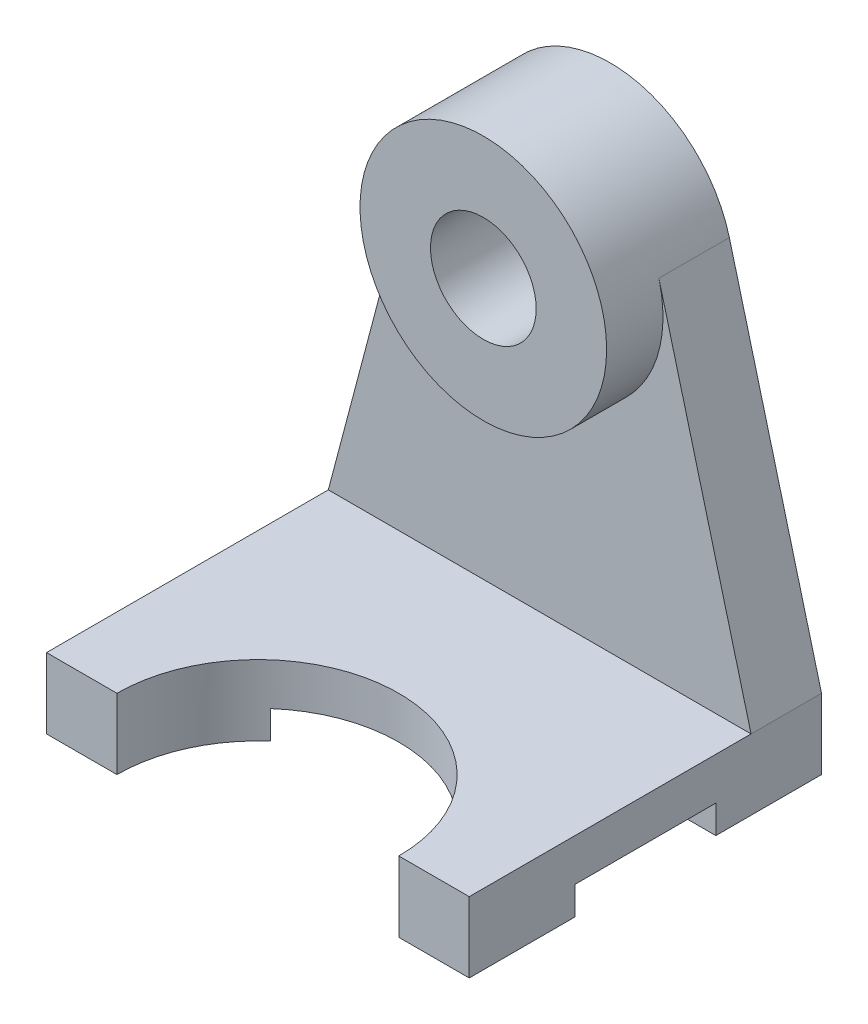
ISO-10303-21;
HEADER;
FILE_DESCRIPTION(('STEP AP214'),'2;1');
FILE_NAME('part.step','',(''),(''),'','','');
FILE_SCHEMA(('AUTOMOTIVE_DESIGN { 1 0 10303 214 1 1 1 1 }'));
ENDSEC;
DATA;
#1=APPLICATION_CONTEXT('core data for automotive mechanical design processes');
#2=APPLICATION_PROTOCOL_DEFINITION('international standard','automotive_design',2000,#1);
#3=PRODUCT_CONTEXT('',#1,'mechanical');
#4=PRODUCT('Part','Part','',(#3));
#5=PRODUCT_RELATED_PRODUCT_CATEGORY('part','',(#4));
#6=PRODUCT_DEFINITION_FORMATION('','',#4);
#7=PRODUCT_DEFINITION_CONTEXT('part definition',#1,'design');
#8=PRODUCT_DEFINITION('design','',#6,#7);
#9=PRODUCT_DEFINITION_SHAPE('','',#8);
#10=(LENGTH_UNIT() NAMED_UNIT(*) SI_UNIT(.MILLI.,.METRE.));
#11=(NAMED_UNIT(*) PLANE_ANGLE_UNIT() SI_UNIT($,.RADIAN.));
#12=(NAMED_UNIT(*) SI_UNIT($,.STERADIAN.) SOLID_ANGLE_UNIT());
#13=UNCERTAINTY_MEASURE_WITH_UNIT(LENGTH_MEASURE(1.E-05),#10,'distance_accuracy_value','');
#14=(GEOMETRIC_REPRESENTATION_CONTEXT(3) GLOBAL_UNCERTAINTY_ASSIGNED_CONTEXT((#13)) GLOBAL_UNIT_ASSIGNED_CONTEXT((#10,
#11,#12)) REPRESENTATION_CONTEXT('',''));
#15=CARTESIAN_POINT('',(0.,0.,0.));
#16=DIRECTION('',(0.,0.,1.));
#17=DIRECTION('',(1.,0.,0.));
#18=AXIS2_PLACEMENT_3D('',#15,#16,#17);
#19=CARTESIAN_POINT('',(30.,55.,-40.));
#20=DIRECTION('',(0.,0.,-1.));
#21=DIRECTION('',(-1.,0.,0.));
#22=AXIS2_PLACEMENT_3D('',#19,#20,#21);
#23=PLANE('',#22);
#24=CARTESIAN_POINT('',(30.,55.,-40.));
#25=DIRECTION('',(0.,0.,1.));
#26=DIRECTION('',(1.,0.,0.));
#27=AXIS2_PLACEMENT_3D('',#24,#25,#26);
#28=CIRCLE('',#27,17.5);
#29=CARTESIAN_POINT('',(13.081433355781,59.4734888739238,-40.));
#30=VERTEX_POINT('',#29);
#31=CARTESIAN_POINT('',(46.918566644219,59.4734888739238,-40.));
#32=VERTEX_POINT('',#31);
#33=EDGE_CURVE('E141',#30,#32,#28,.T.);
#34=ORIENTED_EDGE('',*,*,#33,.F.);
#35=DIRECTION('',(0.255627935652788,0.966775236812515,0.));
#36=VECTOR('',#35,1.);
#37=CARTESIAN_POINT('',(13.081433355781,59.4734888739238,-40.));
#38=LINE('',#37,#36);
#39=CARTESIAN_POINT('',(0.,10.,-40.));
#40=VERTEX_POINT('',#39);
#41=EDGE_CURVE('E48',#40,#30,#38,.T.);
#42=ORIENTED_EDGE('',*,*,#41,.F.);
#43=DIRECTION('',(-1.,0.,0.));
#44=VECTOR('',#43,1.);
#45=CARTESIAN_POINT('',(60.,10.,-40.));
#46=LINE('',#45,#44);
#47=CARTESIAN_POINT('',(60.,10.,-40.));
#48=VERTEX_POINT('',#47);
#49=EDGE_CURVE('E144',#48,#40,#46,.T.);
#50=ORIENTED_EDGE('',*,*,#49,.F.);
#51=DIRECTION('',(0.255627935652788,-0.966775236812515,0.));
#52=VECTOR('',#51,1.);
#53=CARTESIAN_POINT('',(46.918566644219,59.4734888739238,-40.));
#54=LINE('',#53,#52);
#55=EDGE_CURVE('E138',#32,#48,#54,.T.);
#56=ORIENTED_EDGE('',*,*,#55,.F.);
#57=EDGE_LOOP('',(#34,#42,#50,#56));
#58=FACE_BOUND('',#57,.T.);
#59=ADVANCED_FACE('F31',(#58),#23,.F.);
#60=CARTESIAN_POINT('',(30.,10.,0.));
#61=DIRECTION('',(0.,1.,0.));
#62=DIRECTION('',(0.,0.,1.));
#63=AXIS2_PLACEMENT_3D('',#60,#61,#62);
#64=PLANE('',#63);
#65=DIRECTION('',(0.,0.,-1.));
#66=VECTOR('',#65,1.);
#67=CARTESIAN_POINT('',(60.,10.,0.));
#68=LINE('',#67,#66);
#69=CARTESIAN_POINT('',(60.,10.,0.));
#70=VERTEX_POINT('',#69);
#71=EDGE_CURVE('E233',#70,#48,#68,.T.);
#72=ORIENTED_EDGE('',*,*,#71,.T.);
#73=ORIENTED_EDGE('',*,*,#49,.T.);
#74=DIRECTION('',(0.,0.,1.));
#75=VECTOR('',#74,1.);
#76=CARTESIAN_POINT('',(0.,10.,0.));
#77=LINE('',#76,#75);
#78=CARTESIAN_POINT('',(0.,10.,0.));
#79=VERTEX_POINT('',#78);
#80=EDGE_CURVE('E229',#40,#79,#77,.T.);
#81=ORIENTED_EDGE('',*,*,#80,.T.);
#82=DIRECTION('',(1.,0.,0.));
#83=VECTOR('',#82,1.);
#84=CARTESIAN_POINT('',(0.,10.,0.));
#85=LINE('',#84,#83);
#86=CARTESIAN_POINT('',(9.99999999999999,10.,0.));
#87=VERTEX_POINT('',#86);
#88=EDGE_CURVE('E225',#79,#87,#85,.T.);
#89=ORIENTED_EDGE('',*,*,#88,.T.);
#90=CARTESIAN_POINT('',(30.,10.,0.));
#91=DIRECTION('',(0.,-1.,0.));
#92=DIRECTION('',(0.,0.,1.));
#93=AXIS2_PLACEMENT_3D('',#90,#91,#92);
#94=CIRCLE('',#93,20.);
#95=CARTESIAN_POINT('',(50.,10.,0.));
#96=VERTEX_POINT('',#95);
#97=EDGE_CURVE('E291',#87,#96,#94,.T.);
#98=ORIENTED_EDGE('',*,*,#97,.T.);
#99=DIRECTION('',(1.,0.,0.));
#100=VECTOR('',#99,1.);
#101=CARTESIAN_POINT('',(50.,10.,0.));
#102=LINE('',#101,#100);
#103=EDGE_CURVE('E237',#96,#70,#102,.T.);
#104=ORIENTED_EDGE('',*,*,#103,.T.);
#105=EDGE_LOOP('',(#72,#73,#81,#89,#98,#104));
#106=FACE_BOUND('',#105,.T.);
#107=ADVANCED_FACE('F294',(#106),#64,.T.);
#108=CARTESIAN_POINT('',(30.,0.,0.));
#109=DIRECTION('',(0.,1.,0.));
#110=DIRECTION('',(0.,0.,1.));
#111=AXIS2_PLACEMENT_3D('',#108,#109,#110);
#112=PLANE('',#111);
#113=DIRECTION('',(0.,0.,1.));
#114=VECTOR('',#113,1.);
#115=CARTESIAN_POINT('',(0.,0.,0.));
#116=LINE('',#115,#114);
#117=CARTESIAN_POINT('',(0.,0.,-15.));
#118=VERTEX_POINT('',#117);
#119=CARTESIAN_POINT('',(0.,0.,0.));
#120=VERTEX_POINT('',#119);
#121=EDGE_CURVE('E222',#118,#120,#116,.T.);
#122=ORIENTED_EDGE('',*,*,#121,.F.);
#123=DIRECTION('',(1.,0.,0.));
#124=VECTOR('',#123,1.);
#125=CARTESIAN_POINT('',(0.,0.,-15.));
#126=LINE('',#125,#124);
#127=CARTESIAN_POINT('',(16.771243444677,0.,-15.));
#128=VERTEX_POINT('',#127);
#129=EDGE_CURVE('E197',#118,#128,#126,.T.);
#130=ORIENTED_EDGE('',*,*,#129,.T.);
#131=CARTESIAN_POINT('',(30.,0.,0.));
#132=DIRECTION('',(0.,-1.,0.));
#133=DIRECTION('',(0.,0.,1.));
#134=AXIS2_PLACEMENT_3D('',#131,#132,#133);
#135=CIRCLE('',#134,20.);
#136=CARTESIAN_POINT('',(9.99999999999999,0.,0.));
#137=VERTEX_POINT('',#136);
#138=EDGE_CURVE('E247',#137,#128,#135,.T.);
#139=ORIENTED_EDGE('',*,*,#138,.F.);
#140=DIRECTION('',(1.,0.,0.));
#141=VECTOR('',#140,1.);
#142=CARTESIAN_POINT('',(0.,0.,0.));
#143=LINE('',#142,#141);
#144=EDGE_CURVE('E244',#120,#137,#143,.T.);
#145=ORIENTED_EDGE('',*,*,#144,.F.);
#146=EDGE_LOOP('',(#122,#130,#139,#145));
#147=FACE_BOUND('',#146,.T.);
#148=ADVANCED_FACE('F286',(#147),#112,.F.);
#149=CARTESIAN_POINT('',(43.2287565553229,0.,-15.));
#150=VERTEX_POINT('',#149);
#151=CARTESIAN_POINT('',(50.,0.,0.));
#152=VERTEX_POINT('',#151);
#153=EDGE_CURVE('E246',#150,#152,#135,.T.);
#154=ORIENTED_EDGE('',*,*,#153,.F.);
#155=DIRECTION('',(1.,0.,0.));
#156=VECTOR('',#155,1.);
#157=CARTESIAN_POINT('',(30.,0.,-15.));
#158=LINE('',#157,#156);
#159=CARTESIAN_POINT('',(60.,0.,-15.));
#160=VERTEX_POINT('',#159);
#161=EDGE_CURVE('E11',#150,#160,#158,.T.);
#162=ORIENTED_EDGE('',*,*,#161,.T.);
#163=DIRECTION('',(0.,0.,-1.));
#164=VECTOR('',#163,1.);
#165=CARTESIAN_POINT('',(60.,0.,0.));
#166=LINE('',#165,#164);
#167=CARTESIAN_POINT('',(60.,0.,0.));
#168=VERTEX_POINT('',#167);
#169=EDGE_CURVE('E253',#168,#160,#166,.T.);
#170=ORIENTED_EDGE('',*,*,#169,.F.);
#171=DIRECTION('',(1.,0.,0.));
#172=VECTOR('',#171,1.);
#173=CARTESIAN_POINT('',(50.,0.,0.));
#174=LINE('',#173,#172);
#175=EDGE_CURVE('E250',#152,#168,#174,.T.);
#176=ORIENTED_EDGE('',*,*,#175,.F.);
#177=EDGE_LOOP('',(#154,#162,#170,#176));
#178=FACE_BOUND('',#177,.T.);
#179=ADVANCED_FACE('F431',(#178),#112,.F.);
#180=CARTESIAN_POINT('',(0.,10.,0.));
#181=DIRECTION('',(1.,0.,0.));
#182=DIRECTION('',(0.,0.,-1.));
#183=AXIS2_PLACEMENT_3D('',#180,#181,#182);
#184=PLANE('',#183);
#185=DIRECTION('',(0.,0.,1.));
#186=VECTOR('',#185,1.);
#187=CARTESIAN_POINT('',(0.,4.,-15.));
#188=LINE('',#187,#186);
#189=CARTESIAN_POINT('',(0.,4.,-35.));
#190=VERTEX_POINT('',#189);
#191=CARTESIAN_POINT('',(0.,4.,-15.));
#192=VERTEX_POINT('',#191);
#193=EDGE_CURVE('E195',#190,#192,#188,.T.);
#194=ORIENTED_EDGE('',*,*,#193,.T.);
#195=DIRECTION('',(0.,-1.,0.));
#196=VECTOR('',#195,1.);
#197=CARTESIAN_POINT('',(0.,0.,-15.));
#198=LINE('',#197,#196);
#199=EDGE_CURVE('E190',#192,#118,#198,.T.);
#200=ORIENTED_EDGE('',*,*,#199,.T.);
#201=ORIENTED_EDGE('',*,*,#121,.T.);
#202=DIRECTION('',(0.,-1.,0.));
#203=VECTOR('',#202,1.);
#204=CARTESIAN_POINT('',(0.,10.,0.));
#205=LINE('',#204,#203);
#206=EDGE_CURVE('E40',#79,#120,#205,.T.);
#207=ORIENTED_EDGE('',*,*,#206,.F.);
#208=ORIENTED_EDGE('',*,*,#80,.F.);
#209=CARTESIAN_POINT('',(0.,10.,-50.));
#210=VERTEX_POINT('',#209);
#211=EDGE_CURVE('E231',#210,#40,#77,.T.);
#212=ORIENTED_EDGE('',*,*,#211,.F.);
#213=DIRECTION('',(0.,-1.,0.));
#214=VECTOR('',#213,1.);
#215=CARTESIAN_POINT('',(0.,10.,-50.));
#216=LINE('',#215,#214);
#217=CARTESIAN_POINT('',(0.,0.,-50.));
#218=VERTEX_POINT('',#217);
#219=EDGE_CURVE('E236',#210,#218,#216,.T.);
#220=ORIENTED_EDGE('',*,*,#219,.T.);
#221=CARTESIAN_POINT('',(0.,0.,-35.));
#222=VERTEX_POINT('',#221);
#223=EDGE_CURVE('E241',#218,#222,#116,.T.);
#224=ORIENTED_EDGE('',*,*,#223,.T.);
#225=DIRECTION('',(0.,1.,0.));
#226=VECTOR('',#225,1.);
#227=CARTESIAN_POINT('',(0.,0.,-35.));
#228=LINE('',#227,#226);
#229=EDGE_CURVE('E56',#222,#190,#228,.T.);
#230=ORIENTED_EDGE('',*,*,#229,.T.);
#231=EDGE_LOOP('',(#194,#200,#201,#207,#208,#212,#220,#224,#230));
#232=FACE_BOUND('',#231,.T.);
#233=ADVANCED_FACE('F33',(#232),#184,.F.);
#234=CARTESIAN_POINT('',(0.,10.,0.));
#235=DIRECTION('',(0.,0.,-1.));
#236=DIRECTION('',(-1.,0.,0.));
#237=AXIS2_PLACEMENT_3D('',#234,#235,#236);
#238=PLANE('',#237);
#239=ORIENTED_EDGE('',*,*,#144,.T.);
#240=DIRECTION('',(0.,-1.,0.));
#241=VECTOR('',#240,1.);
#242=CARTESIAN_POINT('',(9.99999999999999,10.,0.));
#243=LINE('',#242,#241);
#244=EDGE_CURVE('E269',#87,#137,#243,.T.);
#245=ORIENTED_EDGE('',*,*,#244,.F.);
#246=ORIENTED_EDGE('',*,*,#88,.F.);
#247=ORIENTED_EDGE('',*,*,#206,.T.);
#248=EDGE_LOOP('',(#239,#245,#246,#247));
#249=FACE_BOUND('',#248,.T.);
#250=ADVANCED_FACE('F276',(#249),#238,.F.);
#251=CARTESIAN_POINT('',(30.,10.,0.));
#252=DIRECTION('',(0.,-1.,0.));
#253=DIRECTION('',(0.,0.,-1.));
#254=AXIS2_PLACEMENT_3D('',#251,#252,#253);
#255=CYLINDRICAL_SURFACE('',#254,20.);
#256=ORIENTED_EDGE('',*,*,#138,.T.);
#257=DIRECTION('',(0.,-1.,0.));
#258=VECTOR('',#257,1.);
#259=CARTESIAN_POINT('',(16.771243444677,10.,-15.));
#260=LINE('',#259,#258);
#261=CARTESIAN_POINT('',(16.771243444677,4.,-15.));
#262=VERTEX_POINT('',#261);
#263=EDGE_CURVE('E216',#128,#262,#260,.F.);
#264=ORIENTED_EDGE('',*,*,#263,.T.);
#265=CARTESIAN_POINT('',(30.,4.,0.));
#266=DIRECTION('',(0.,1.,0.));
#267=DIRECTION('',(0.,0.,1.));
#268=AXIS2_PLACEMENT_3D('',#265,#266,#267);
#269=CIRCLE('',#268,20.);
#270=CARTESIAN_POINT('',(43.228756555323,4.,-15.));
#271=VERTEX_POINT('',#270);
#272=EDGE_CURVE('E219',#262,#271,#269,.F.);
#273=ORIENTED_EDGE('',*,*,#272,.T.);
#274=DIRECTION('',(0.,-1.,0.));
#275=VECTOR('',#274,1.);
#276=CARTESIAN_POINT('',(43.228756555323,10.,-15.));
#277=LINE('',#276,#275);
#278=EDGE_CURVE('E206',#271,#150,#277,.T.);
#279=ORIENTED_EDGE('',*,*,#278,.T.);
#280=ORIENTED_EDGE('',*,*,#153,.T.);
#281=DIRECTION('',(0.,-1.,0.));
#282=VECTOR('',#281,1.);
#283=CARTESIAN_POINT('',(50.,10.,0.));
#284=LINE('',#283,#282);
#285=EDGE_CURVE('E266',#96,#152,#284,.T.);
#286=ORIENTED_EDGE('',*,*,#285,.F.);
#287=ORIENTED_EDGE('',*,*,#97,.F.);
#288=ORIENTED_EDGE('',*,*,#244,.T.);
#289=EDGE_LOOP('',(#256,#264,#273,#279,#280,#286,#287,#288));
#290=FACE_BOUND('',#289,.T.);
#291=ADVANCED_FACE('F288',(#290),#255,.F.);
#292=CARTESIAN_POINT('',(50.,10.,0.));
#293=DIRECTION('',(0.,0.,-1.));
#294=DIRECTION('',(-1.,0.,0.));
#295=AXIS2_PLACEMENT_3D('',#292,#293,#294);
#296=PLANE('',#295);
#297=ORIENTED_EDGE('',*,*,#175,.T.);
#298=DIRECTION('',(0.,-1.,0.));
#299=VECTOR('',#298,1.);
#300=CARTESIAN_POINT('',(60.,10.,0.));
#301=LINE('',#300,#299);
#302=EDGE_CURVE('E263',#70,#168,#301,.T.);
#303=ORIENTED_EDGE('',*,*,#302,.F.);
#304=ORIENTED_EDGE('',*,*,#103,.F.);
#305=ORIENTED_EDGE('',*,*,#285,.T.);
#306=EDGE_LOOP('',(#297,#303,#304,#305));
#307=FACE_BOUND('',#306,.T.);
#308=ADVANCED_FACE('F450',(#307),#296,.F.);
#309=CARTESIAN_POINT('',(60.,10.,0.));
#310=DIRECTION('',(-1.,0.,0.));
#311=DIRECTION('',(0.,0.,1.));
#312=AXIS2_PLACEMENT_3D('',#309,#310,#311);
#313=PLANE('',#312);
#314=ORIENTED_EDGE('',*,*,#169,.T.);
#315=DIRECTION('',(0.,-1.,0.));
#316=VECTOR('',#315,1.);
#317=CARTESIAN_POINT('',(60.,0.,-15.));
#318=LINE('',#317,#316);
#319=CARTESIAN_POINT('',(60.,4.,-15.));
#320=VERTEX_POINT('',#319);
#321=EDGE_CURVE('E183',#320,#160,#318,.T.);
#322=ORIENTED_EDGE('',*,*,#321,.F.);
#323=DIRECTION('',(0.,0.,1.));
#324=VECTOR('',#323,1.);
#325=CARTESIAN_POINT('',(60.,4.,-15.));
#326=LINE('',#325,#324);
#327=CARTESIAN_POINT('',(60.,4.,-35.));
#328=VERTEX_POINT('',#327);
#329=EDGE_CURVE('E193',#328,#320,#326,.T.);
#330=ORIENTED_EDGE('',*,*,#329,.F.);
#331=DIRECTION('',(0.,1.,0.));
#332=VECTOR('',#331,1.);
#333=CARTESIAN_POINT('',(60.,0.,-35.));
#334=LINE('',#333,#332);
#335=CARTESIAN_POINT('',(60.,0.,-35.));
#336=VERTEX_POINT('',#335);
#337=EDGE_CURVE('E186',#336,#328,#334,.T.);
#338=ORIENTED_EDGE('',*,*,#337,.F.);
#339=CARTESIAN_POINT('',(60.,0.,-50.));
#340=VERTEX_POINT('',#339);
#341=EDGE_CURVE('E252',#336,#340,#166,.T.);
#342=ORIENTED_EDGE('',*,*,#341,.T.);
#343=DIRECTION('',(0.,-1.,0.));
#344=VECTOR('',#343,1.);
#345=CARTESIAN_POINT('',(60.,10.,-50.));
#346=LINE('',#345,#344);
#347=CARTESIAN_POINT('',(60.,10.,-50.));
#348=VERTEX_POINT('',#347);
#349=EDGE_CURVE('E260',#348,#340,#346,.T.);
#350=ORIENTED_EDGE('',*,*,#349,.F.);
#351=DIRECTION('',(0.,0.,-1.));
#352=VECTOR('',#351,1.);
#353=CARTESIAN_POINT('',(60.,10.,-40.));
#354=LINE('',#353,#352);
#355=EDGE_CURVE('E156',#48,#348,#354,.T.);
#356=ORIENTED_EDGE('',*,*,#355,.F.);
#357=ORIENTED_EDGE('',*,*,#71,.F.);
#358=ORIENTED_EDGE('',*,*,#302,.T.);
#359=EDGE_LOOP('',(#314,#322,#330,#338,#342,#350,#356,#357,#358));
#360=FACE_BOUND('',#359,.T.);
#361=ADVANCED_FACE('F298',(#360),#313,.F.);
#362=CARTESIAN_POINT('',(0.,10.,-50.));
#363=DIRECTION('',(0.,0.,1.));
#364=DIRECTION('',(1.,0.,0.));
#365=AXIS2_PLACEMENT_3D('',#362,#363,#364);
#366=PLANE('',#365);
#367=DIRECTION('',(-1.,0.,0.));
#368=VECTOR('',#367,1.);
#369=CARTESIAN_POINT('',(0.,0.,-50.));
#370=LINE('',#369,#368);
#371=EDGE_CURVE('E256',#340,#218,#370,.T.);
#372=ORIENTED_EDGE('',*,*,#371,.T.);
#373=ORIENTED_EDGE('',*,*,#219,.F.);
#374=DIRECTION('',(0.255627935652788,0.966775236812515,0.));
#375=VECTOR('',#374,1.);
#376=CARTESIAN_POINT('',(13.081433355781,59.4734888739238,-50.));
#377=LINE('',#376,#375);
#378=CARTESIAN_POINT('',(13.081433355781,59.4734888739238,-50.));
#379=VERTEX_POINT('',#378);
#380=EDGE_CURVE('E147',#210,#379,#377,.T.);
#381=ORIENTED_EDGE('',*,*,#380,.T.);
#382=CARTESIAN_POINT('',(30.,55.,-50.));
#383=DIRECTION('',(0.,0.,-1.));
#384=DIRECTION('',(-1.,0.,0.));
#385=AXIS2_PLACEMENT_3D('',#382,#383,#384);
#386=CIRCLE('',#385,17.5);
#387=CARTESIAN_POINT('',(46.918566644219,59.4734888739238,-50.));
#388=VERTEX_POINT('',#387);
#389=EDGE_CURVE('E172',#379,#388,#386,.T.);
#390=ORIENTED_EDGE('',*,*,#389,.T.);
#391=DIRECTION('',(0.255627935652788,-0.966775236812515,0.));
#392=VECTOR('',#391,1.);
#393=CARTESIAN_POINT('',(46.918566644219,59.4734888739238,-50.));
#394=LINE('',#393,#392);
#395=EDGE_CURVE('E152',#388,#348,#394,.T.);
#396=ORIENTED_EDGE('',*,*,#395,.T.);
#397=ORIENTED_EDGE('',*,*,#349,.T.);
#398=EDGE_LOOP('',(#372,#373,#381,#390,#396,#397));
#399=FACE_BOUND('',#398,.T.);
#400=CARTESIAN_POINT('',(30.,55.,-50.));
#401=DIRECTION('',(0.,0.,-1.));
#402=DIRECTION('',(-1.,0.,0.));
#403=AXIS2_PLACEMENT_3D('',#400,#401,#402);
#404=CIRCLE('',#403,7.5);
#405=CARTESIAN_POINT('',(22.5,55.,-50.));
#406=VERTEX_POINT('',#405);
#407=EDGE_CURVE('E165',#406,#406,#404,.T.);
#408=ORIENTED_EDGE('',*,*,#407,.F.);
#409=EDGE_LOOP('',(#408));
#410=FACE_BOUND('',#409,.T.);
#411=ADVANCED_FACE('F305',(#399,#410),#366,.F.);
#412=ORIENTED_EDGE('',*,*,#341,.F.);
#413=DIRECTION('',(1.,0.,0.));
#414=VECTOR('',#413,1.);
#415=CARTESIAN_POINT('',(0.,0.,-35.));
#416=LINE('',#415,#414);
#417=EDGE_CURVE('E210',#222,#336,#416,.T.);
#418=ORIENTED_EDGE('',*,*,#417,.F.);
#419=ORIENTED_EDGE('',*,*,#223,.F.);
#420=ORIENTED_EDGE('',*,*,#371,.F.);
#421=EDGE_LOOP('',(#412,#418,#419,#420));
#422=FACE_BOUND('',#421,.T.);
#423=ADVANCED_FACE('F310',(#422),#112,.F.);
#424=CARTESIAN_POINT('',(0.,4.,-15.));
#425=DIRECTION('',(0.,1.,0.));
#426=DIRECTION('',(0.,0.,1.));
#427=AXIS2_PLACEMENT_3D('',#424,#425,#426);
#428=PLANE('',#427);
#429=DIRECTION('',(1.,0.,0.));
#430=VECTOR('',#429,1.);
#431=CARTESIAN_POINT('',(0.,4.,-15.));
#432=LINE('',#431,#430);
#433=EDGE_CURVE('E203',#192,#262,#432,.T.);
#434=ORIENTED_EDGE('',*,*,#433,.F.);
#435=ORIENTED_EDGE('',*,*,#193,.F.);
#436=DIRECTION('',(1.,0.,0.));
#437=VECTOR('',#436,1.);
#438=CARTESIAN_POINT('',(0.,4.,-35.));
#439=LINE('',#438,#437);
#440=EDGE_CURVE('E208',#190,#328,#439,.T.);
#441=ORIENTED_EDGE('',*,*,#440,.T.);
#442=ORIENTED_EDGE('',*,*,#329,.T.);
#443=EDGE_CURVE('E207',#271,#320,#432,.T.);
#444=ORIENTED_EDGE('',*,*,#443,.F.);
#445=ORIENTED_EDGE('',*,*,#272,.F.);
#446=EDGE_LOOP('',(#434,#435,#441,#442,#444,#445));
#447=FACE_BOUND('',#446,.T.);
#448=ADVANCED_FACE('F414',(#447),#428,.F.);
#449=CARTESIAN_POINT('',(0.,0.,-15.));
#450=DIRECTION('',(0.,0.,1.));
#451=DIRECTION('',(1.,0.,0.));
#452=AXIS2_PLACEMENT_3D('',#449,#450,#451);
#453=PLANE('',#452);
#454=ORIENTED_EDGE('',*,*,#129,.F.);
#455=ORIENTED_EDGE('',*,*,#199,.F.);
#456=ORIENTED_EDGE('',*,*,#433,.T.);
#457=ORIENTED_EDGE('',*,*,#263,.F.);
#458=EDGE_LOOP('',(#454,#455,#456,#457));
#459=FACE_BOUND('',#458,.T.);
#460=ADVANCED_FACE('F405',(#459),#453,.F.);
#461=ORIENTED_EDGE('',*,*,#443,.T.);
#462=ORIENTED_EDGE('',*,*,#321,.T.);
#463=ORIENTED_EDGE('',*,*,#161,.F.);
#464=ORIENTED_EDGE('',*,*,#278,.F.);
#465=EDGE_LOOP('',(#461,#462,#463,#464));
#466=FACE_BOUND('',#465,.T.);
#467=ADVANCED_FACE('F397',(#466),#453,.F.);
#468=CARTESIAN_POINT('',(0.,0.,-35.));
#469=DIRECTION('',(0.,0.,-1.));
#470=DIRECTION('',(-1.,0.,0.));
#471=AXIS2_PLACEMENT_3D('',#468,#469,#470);
#472=PLANE('',#471);
#473=ORIENTED_EDGE('',*,*,#337,.T.);
#474=ORIENTED_EDGE('',*,*,#440,.F.);
#475=ORIENTED_EDGE('',*,*,#229,.F.);
#476=ORIENTED_EDGE('',*,*,#417,.T.);
#477=EDGE_LOOP('',(#473,#474,#475,#476));
#478=FACE_BOUND('',#477,.T.);
#479=ADVANCED_FACE('F321',(#478),#472,.F.);
#480=CARTESIAN_POINT('',(30.,55.,-40.));
#481=DIRECTION('',(0.,0.,-1.));
#482=DIRECTION('',(-1.,0.,0.));
#483=AXIS2_PLACEMENT_3D('',#480,#481,#482);
#484=CYLINDRICAL_SURFACE('',#483,17.5);
#485=ORIENTED_EDGE('',*,*,#389,.F.);
#486=DIRECTION('',(0.,0.,-1.));
#487=VECTOR('',#486,1.);
#488=CARTESIAN_POINT('',(13.081433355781,59.4734888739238,-40.));
#489=LINE('',#488,#487);
#490=EDGE_CURVE('E160',#30,#379,#489,.T.);
#491=ORIENTED_EDGE('',*,*,#490,.F.);
#492=ORIENTED_EDGE('',*,*,#33,.T.);
#493=DIRECTION('',(0.,0.,-1.));
#494=VECTOR('',#493,1.);
#495=CARTESIAN_POINT('',(46.918566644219,59.4734888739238,-40.));
#496=LINE('',#495,#494);
#497=EDGE_CURVE('E149',#32,#388,#496,.T.);
#498=ORIENTED_EDGE('',*,*,#497,.T.);
#499=EDGE_LOOP('',(#485,#491,#492,#498));
#500=FACE_BOUND('',#499,.T.);
#501=CARTESIAN_POINT('',(30.,55.,-32.));
#502=DIRECTION('',(0.,0.,1.));
#503=DIRECTION('',(1.,0.,0.));
#504=AXIS2_PLACEMENT_3D('',#501,#502,#503);
#505=CIRCLE('',#504,17.5);
#506=CARTESIAN_POINT('',(47.5,55.,-32.));
#507=VERTEX_POINT('',#506);
#508=EDGE_CURVE('E161',#507,#507,#505,.T.);
#509=ORIENTED_EDGE('',*,*,#508,.F.);
#510=EDGE_LOOP('',(#509));
#511=FACE_BOUND('',#510,.T.);
#512=ADVANCED_FACE('F158',(#500,#511),#484,.T.);
#513=CARTESIAN_POINT('',(13.081433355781,59.4734888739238,-40.));
#514=DIRECTION('',(-0.966775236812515,0.255627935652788,0.));
#515=DIRECTION('',(-0.255627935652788,-0.966775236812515,0.));
#516=AXIS2_PLACEMENT_3D('',#513,#514,#515);
#517=PLANE('',#516);
#518=ORIENTED_EDGE('',*,*,#380,.F.);
#519=ORIENTED_EDGE('',*,*,#211,.T.);
#520=ORIENTED_EDGE('',*,*,#41,.T.);
#521=ORIENTED_EDGE('',*,*,#490,.T.);
#522=EDGE_LOOP('',(#518,#519,#520,#521));
#523=FACE_BOUND('',#522,.T.);
#524=ADVANCED_FACE('F312',(#523),#517,.T.);
#525=CARTESIAN_POINT('',(46.918566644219,59.4734888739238,-40.));
#526=DIRECTION('',(0.966775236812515,0.255627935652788,0.));
#527=DIRECTION('',(-0.255627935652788,0.966775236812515,0.));
#528=AXIS2_PLACEMENT_3D('',#525,#526,#527);
#529=PLANE('',#528);
#530=ORIENTED_EDGE('',*,*,#395,.F.);
#531=ORIENTED_EDGE('',*,*,#497,.F.);
#532=ORIENTED_EDGE('',*,*,#55,.T.);
#533=ORIENTED_EDGE('',*,*,#355,.T.);
#534=EDGE_LOOP('',(#530,#531,#532,#533));
#535=FACE_BOUND('',#534,.T.);
#536=ADVANCED_FACE('F150',(#535),#529,.T.);
#537=CARTESIAN_POINT('',(30.,55.,-40.));
#538=DIRECTION('',(0.,0.,-1.));
#539=DIRECTION('',(-1.,0.,0.));
#540=AXIS2_PLACEMENT_3D('',#537,#538,#539);
#541=CYLINDRICAL_SURFACE('',#540,7.5);
#542=ORIENTED_EDGE('',*,*,#407,.T.);
#543=EDGE_LOOP('',(#542));
#544=FACE_BOUND('',#543,.T.);
#545=CARTESIAN_POINT('',(30.,55.,-32.));
#546=DIRECTION('',(0.,0.,1.));
#547=DIRECTION('',(1.,0.,0.));
#548=AXIS2_PLACEMENT_3D('',#545,#546,#547);
#549=CIRCLE('',#548,7.5);
#550=CARTESIAN_POINT('',(37.5,55.,-32.));
#551=VERTEX_POINT('',#550);
#552=EDGE_CURVE('E162',#551,#551,#549,.T.);
#553=ORIENTED_EDGE('',*,*,#552,.T.);
#554=EDGE_LOOP('',(#553));
#555=FACE_BOUND('',#554,.T.);
#556=ADVANCED_FACE('F319',(#544,#555),#541,.F.);
#557=CARTESIAN_POINT('',(30.,55.,-32.));
#558=DIRECTION('',(0.,0.,1.));
#559=DIRECTION('',(1.,0.,0.));
#560=AXIS2_PLACEMENT_3D('',#557,#558,#559);
#561=PLANE('',#560);
#562=ORIENTED_EDGE('',*,*,#508,.T.);
#563=EDGE_LOOP('',(#562));
#564=FACE_BOUND('',#563,.T.);
#565=ORIENTED_EDGE('',*,*,#552,.F.);
#566=EDGE_LOOP('',(#565));
#567=FACE_BOUND('',#566,.T.);
#568=ADVANCED_FACE('F332',(#564,#567),#561,.T.);
#569=CLOSED_SHELL('',(#59,#107,#148,#179,#233,#250,#291,#308,#361,#411,#423,#448,#460,#467,#479,
#512,#524,#536,#556,#568));
#570=MANIFOLD_SOLID_BREP('B2',#569);
#571=ADVANCED_BREP_SHAPE_REPRESENTATION('',(#18,#570),#14);
#572=SHAPE_DEFINITION_REPRESENTATION(#9,#571);
ENDSEC;
END-ISO-10303-21;
